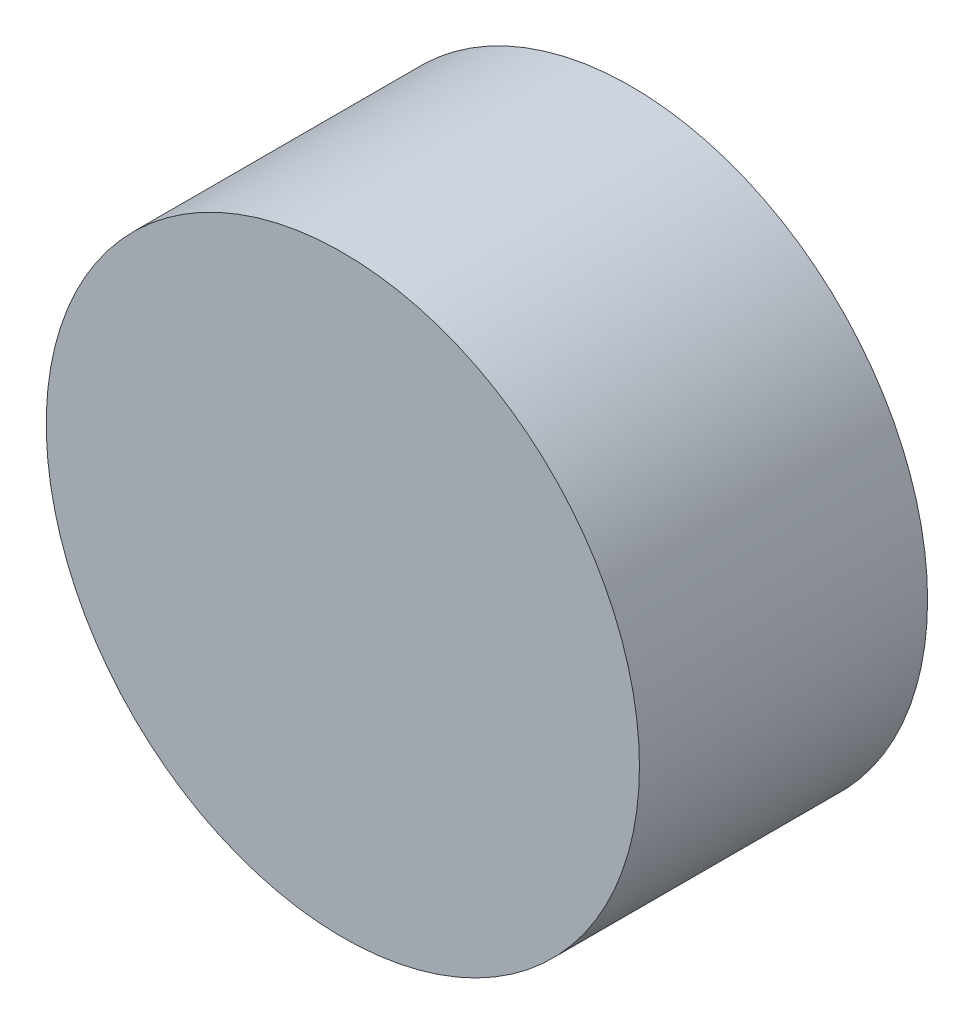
from build123d import *

# Parameters (mm, degrees)
SKETCH1_R           = 22.225
BOSS_EXTRUDE1_DEPTH = 10.795


with BuildPart() as part:
    # Sketch1 → Boss-Extrude1 (new, symmetric)
    with BuildSketch(Plane.XY):
        Circle(SKETCH1_R)
    extrude(amount=BOSS_EXTRUDE1_DEPTH, both=True)


solid = part.part
